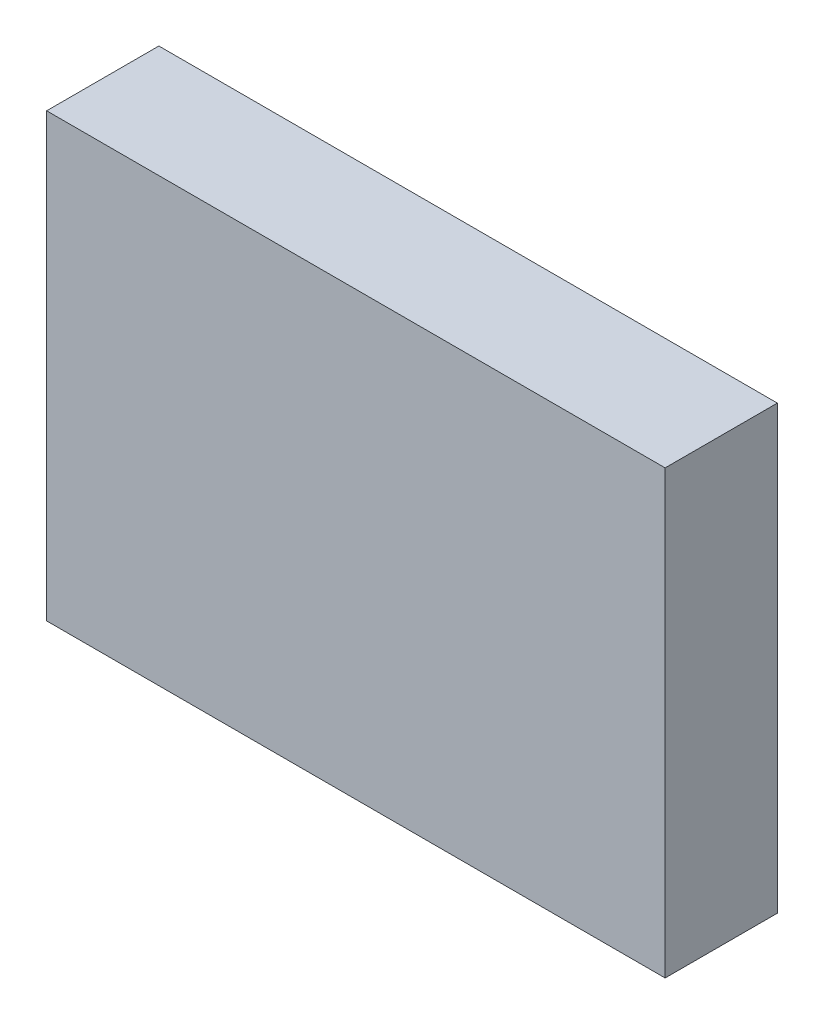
ISO-10303-21;
HEADER;
FILE_DESCRIPTION(('STEP AP214'),'2;1');
FILE_NAME('part.step','',(''),(''),'','','');
FILE_SCHEMA(('AUTOMOTIVE_DESIGN { 1 0 10303 214 1 1 1 1 }'));
ENDSEC;
DATA;
#1=APPLICATION_CONTEXT('core data for automotive mechanical design processes');
#2=APPLICATION_PROTOCOL_DEFINITION('international standard','automotive_design',2000,#1);
#3=PRODUCT_CONTEXT('',#1,'mechanical');
#4=PRODUCT('Part','Part','',(#3));
#5=PRODUCT_RELATED_PRODUCT_CATEGORY('part','',(#4));
#6=PRODUCT_DEFINITION_FORMATION('','',#4);
#7=PRODUCT_DEFINITION_CONTEXT('part definition',#1,'design');
#8=PRODUCT_DEFINITION('design','',#6,#7);
#9=PRODUCT_DEFINITION_SHAPE('','',#8);
#10=(LENGTH_UNIT() NAMED_UNIT(*) SI_UNIT(.MILLI.,.METRE.));
#11=(NAMED_UNIT(*) PLANE_ANGLE_UNIT() SI_UNIT($,.RADIAN.));
#12=(NAMED_UNIT(*) SI_UNIT($,.STERADIAN.) SOLID_ANGLE_UNIT());
#13=UNCERTAINTY_MEASURE_WITH_UNIT(LENGTH_MEASURE(1.E-05),#10,'distance_accuracy_value','');
#14=(GEOMETRIC_REPRESENTATION_CONTEXT(3) GLOBAL_UNCERTAINTY_ASSIGNED_CONTEXT((#13)) GLOBAL_UNIT_ASSIGNED_CONTEXT((#10,
#11,#12)) REPRESENTATION_CONTEXT('',''));
#15=CARTESIAN_POINT('',(0.,0.,0.));
#16=DIRECTION('',(0.,0.,1.));
#17=DIRECTION('',(1.,0.,0.));
#18=AXIS2_PLACEMENT_3D('',#15,#16,#17);
#19=CARTESIAN_POINT('',(-1.74999904,1.25000004,0.635));
#20=DIRECTION('',(0.,0.,-1.));
#21=DIRECTION('',(-1.,0.,0.));
#22=AXIS2_PLACEMENT_3D('',#19,#20,#21);
#23=PLANE('',#22);
#24=DIRECTION('',(1.,0.,0.));
#25=VECTOR('',#24,1.);
#26=CARTESIAN_POINT('',(-1.74999904,-1.25000004,0.635));
#27=LINE('',#26,#25);
#28=CARTESIAN_POINT('',(-1.74999904,-1.25000004,0.635));
#29=VERTEX_POINT('',#28);
#30=CARTESIAN_POINT('',(1.74999904,-1.25000004,0.635));
#31=VERTEX_POINT('',#30);
#32=EDGE_CURVE('E54',#29,#31,#27,.T.);
#33=ORIENTED_EDGE('',*,*,#32,.T.);
#34=DIRECTION('',(0.,1.,0.));
#35=VECTOR('',#34,1.);
#36=CARTESIAN_POINT('',(1.74999904,-1.25000004,0.635));
#37=LINE('',#36,#35);
#38=CARTESIAN_POINT('',(1.74999904,1.25000004,0.635));
#39=VERTEX_POINT('',#38);
#40=EDGE_CURVE('E56',#31,#39,#37,.T.);
#41=ORIENTED_EDGE('',*,*,#40,.T.);
#42=DIRECTION('',(1.,0.,0.));
#43=VECTOR('',#42,1.);
#44=CARTESIAN_POINT('',(1.74999904,1.25000004,0.635));
#45=LINE('',#44,#43);
#46=CARTESIAN_POINT('',(-1.74999904,1.25000004,0.635));
#47=VERTEX_POINT('',#46);
#48=EDGE_CURVE('E19',#39,#47,#45,.F.);
#49=ORIENTED_EDGE('',*,*,#48,.T.);
#50=DIRECTION('',(0.,1.,0.));
#51=VECTOR('',#50,1.);
#52=CARTESIAN_POINT('',(-1.74999904,1.25000004,0.635));
#53=LINE('',#52,#51);
#54=EDGE_CURVE('E79',#47,#29,#53,.F.);
#55=ORIENTED_EDGE('',*,*,#54,.T.);
#56=EDGE_LOOP('',(#33,#41,#49,#55));
#57=FACE_BOUND('',#56,.T.);
#58=ADVANCED_FACE('F16',(#57),#23,.F.);
#59=CARTESIAN_POINT('',(1.74999904,1.25000004,0.));
#60=DIRECTION('',(0.,-1.,0.));
#61=DIRECTION('',(0.,0.,-1.));
#62=AXIS2_PLACEMENT_3D('',#59,#60,#61);
#63=PLANE('',#62);
#64=DIRECTION('',(0.,0.,-1.));
#65=VECTOR('',#64,1.);
#66=CARTESIAN_POINT('',(-1.74999904,1.25000004,0.));
#67=LINE('',#66,#65);
#68=CARTESIAN_POINT('',(-1.74999904,1.25000004,0.));
#69=VERTEX_POINT('',#68);
#70=EDGE_CURVE('E67',#69,#47,#67,.F.);
#71=ORIENTED_EDGE('',*,*,#70,.T.);
#72=ORIENTED_EDGE('',*,*,#48,.F.);
#73=DIRECTION('',(0.,0.,1.));
#74=VECTOR('',#73,1.);
#75=CARTESIAN_POINT('',(1.74999904,1.25000004,0.));
#76=LINE('',#75,#74);
#77=CARTESIAN_POINT('',(1.74999904,1.25000004,0.));
#78=VERTEX_POINT('',#77);
#79=EDGE_CURVE('E62',#39,#78,#76,.F.);
#80=ORIENTED_EDGE('',*,*,#79,.T.);
#81=DIRECTION('',(-1.,0.,0.));
#82=VECTOR('',#81,1.);
#83=CARTESIAN_POINT('',(-1.74999904,1.25000004,0.));
#84=LINE('',#83,#82);
#85=EDGE_CURVE('E82',#69,#78,#84,.F.);
#86=ORIENTED_EDGE('',*,*,#85,.F.);
#87=EDGE_LOOP('',(#71,#72,#80,#86));
#88=FACE_BOUND('',#87,.T.);
#89=ADVANCED_FACE('F64',(#88),#63,.F.);
#90=CARTESIAN_POINT('',(1.74999904,-1.25000004,0.));
#91=DIRECTION('',(-1.,0.,0.));
#92=DIRECTION('',(0.,0.,1.));
#93=AXIS2_PLACEMENT_3D('',#90,#91,#92);
#94=PLANE('',#93);
#95=ORIENTED_EDGE('',*,*,#79,.F.);
#96=ORIENTED_EDGE('',*,*,#40,.F.);
#97=DIRECTION('',(0.,0.,1.));
#98=VECTOR('',#97,1.);
#99=CARTESIAN_POINT('',(1.74999904,-1.25000004,0.));
#100=LINE('',#99,#98);
#101=CARTESIAN_POINT('',(1.74999904,-1.25000004,0.));
#102=VERTEX_POINT('',#101);
#103=EDGE_CURVE('E74',#31,#102,#100,.F.);
#104=ORIENTED_EDGE('',*,*,#103,.T.);
#105=DIRECTION('',(0.,1.,0.));
#106=VECTOR('',#105,1.);
#107=CARTESIAN_POINT('',(1.74999904,1.25000004,0.));
#108=LINE('',#107,#106);
#109=EDGE_CURVE('E71',#78,#102,#108,.F.);
#110=ORIENTED_EDGE('',*,*,#109,.F.);
#111=EDGE_LOOP('',(#95,#96,#104,#110));
#112=FACE_BOUND('',#111,.T.);
#113=ADVANCED_FACE('F69',(#112),#94,.F.);
#114=CARTESIAN_POINT('',(-1.74999904,-1.25000004,0.));
#115=DIRECTION('',(0.,1.,0.));
#116=DIRECTION('',(0.,0.,1.));
#117=AXIS2_PLACEMENT_3D('',#114,#115,#116);
#118=PLANE('',#117);
#119=ORIENTED_EDGE('',*,*,#103,.F.);
#120=ORIENTED_EDGE('',*,*,#32,.F.);
#121=DIRECTION('',(0.,0.,-1.));
#122=VECTOR('',#121,1.);
#123=CARTESIAN_POINT('',(-1.74999904,-1.25000004,0.));
#124=LINE('',#123,#122);
#125=CARTESIAN_POINT('',(-1.74999904,-1.25000004,0.));
#126=VERTEX_POINT('',#125);
#127=EDGE_CURVE('E34',#29,#126,#124,.T.);
#128=ORIENTED_EDGE('',*,*,#127,.T.);
#129=DIRECTION('',(-1.,0.,0.));
#130=VECTOR('',#129,1.);
#131=CARTESIAN_POINT('',(-1.74999904,-1.25000004,0.));
#132=LINE('',#131,#130);
#133=EDGE_CURVE('E25',#102,#126,#132,.T.);
#134=ORIENTED_EDGE('',*,*,#133,.F.);
#135=EDGE_LOOP('',(#119,#120,#128,#134));
#136=FACE_BOUND('',#135,.T.);
#137=ADVANCED_FACE('F88',(#136),#118,.F.);
#138=CARTESIAN_POINT('',(-1.74999904,1.25000004,0.));
#139=DIRECTION('',(1.,0.,0.));
#140=DIRECTION('',(0.,0.,-1.));
#141=AXIS2_PLACEMENT_3D('',#138,#139,#140);
#142=PLANE('',#141);
#143=ORIENTED_EDGE('',*,*,#127,.F.);
#144=ORIENTED_EDGE('',*,*,#54,.F.);
#145=ORIENTED_EDGE('',*,*,#70,.F.);
#146=DIRECTION('',(0.,1.,0.));
#147=VECTOR('',#146,1.);
#148=CARTESIAN_POINT('',(-1.74999904,1.25000004,0.));
#149=LINE('',#148,#147);
#150=EDGE_CURVE('E11',#126,#69,#149,.T.);
#151=ORIENTED_EDGE('',*,*,#150,.F.);
#152=EDGE_LOOP('',(#143,#144,#145,#151));
#153=FACE_BOUND('',#152,.T.);
#154=ADVANCED_FACE('F90',(#153),#142,.F.);
#155=CARTESIAN_POINT('',(-1.74999904,1.25000004,0.));
#156=DIRECTION('',(0.,0.,-1.));
#157=DIRECTION('',(-1.,0.,0.));
#158=AXIS2_PLACEMENT_3D('',#155,#156,#157);
#159=PLANE('',#158);
#160=ORIENTED_EDGE('',*,*,#133,.T.);
#161=ORIENTED_EDGE('',*,*,#150,.T.);
#162=ORIENTED_EDGE('',*,*,#85,.T.);
#163=ORIENTED_EDGE('',*,*,#109,.T.);
#164=EDGE_LOOP('',(#160,#161,#162,#163));
#165=FACE_BOUND('',#164,.T.);
#166=ADVANCED_FACE('F87',(#165),#159,.T.);
#167=CLOSED_SHELL('',(#58,#89,#113,#137,#154,#166));
#168=MANIFOLD_SOLID_BREP('B1',#167);
#169=ADVANCED_BREP_SHAPE_REPRESENTATION('',(#18,#168),#14);
#170=SHAPE_DEFINITION_REPRESENTATION(#9,#169);
ENDSEC;
END-ISO-10303-21;
